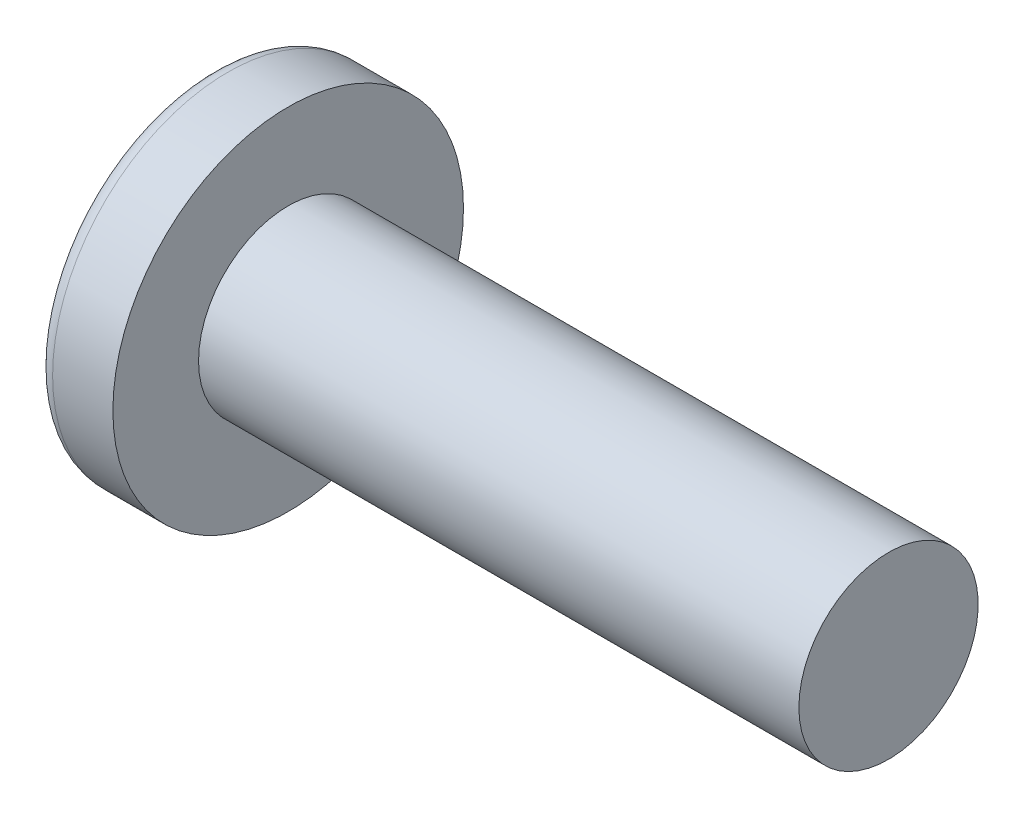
ISO-10303-21;
HEADER;
FILE_DESCRIPTION(('STEP AP214'),'2;1');
FILE_NAME('part.step','',(''),(''),'','','');
FILE_SCHEMA(('AUTOMOTIVE_DESIGN { 1 0 10303 214 1 1 1 1 }'));
ENDSEC;
DATA;
#1=APPLICATION_CONTEXT('core data for automotive mechanical design processes');
#2=APPLICATION_PROTOCOL_DEFINITION('international standard','automotive_design',2000,#1);
#3=PRODUCT_CONTEXT('',#1,'mechanical');
#4=PRODUCT('Part','Part','',(#3));
#5=PRODUCT_RELATED_PRODUCT_CATEGORY('part','',(#4));
#6=PRODUCT_DEFINITION_FORMATION('','',#4);
#7=PRODUCT_DEFINITION_CONTEXT('part definition',#1,'design');
#8=PRODUCT_DEFINITION('design','',#6,#7);
#9=PRODUCT_DEFINITION_SHAPE('','',#8);
#10=(LENGTH_UNIT() NAMED_UNIT(*) SI_UNIT(.MILLI.,.METRE.));
#11=(NAMED_UNIT(*) PLANE_ANGLE_UNIT() SI_UNIT($,.RADIAN.));
#12=(NAMED_UNIT(*) SI_UNIT($,.STERADIAN.) SOLID_ANGLE_UNIT());
#13=UNCERTAINTY_MEASURE_WITH_UNIT(LENGTH_MEASURE(1.E-05),#10,'distance_accuracy_value','');
#14=(GEOMETRIC_REPRESENTATION_CONTEXT(3) GLOBAL_UNCERTAINTY_ASSIGNED_CONTEXT((#13)) GLOBAL_UNIT_ASSIGNED_CONTEXT((#10,
#11,#12)) REPRESENTATION_CONTEXT('',''));
#15=CARTESIAN_POINT('',(0.,0.,0.));
#16=DIRECTION('',(0.,0.,1.));
#17=DIRECTION('',(1.,0.,0.));
#18=AXIS2_PLACEMENT_3D('',#15,#16,#17);
#19=CARTESIAN_POINT('',(4.55168,0.,0.));
#20=DIRECTION('',(-1.,0.,0.));
#21=DIRECTION('',(0.,1.,0.));
#22=AXIS2_PLACEMENT_3D('',#19,#20,#21);
#23=SPHERICAL_SURFACE('',#22,4.55168);
#24=CARTESIAN_POINT('',(0.870207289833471,0.,0.));
#25=DIRECTION('',(-1.,0.,0.));
#26=DIRECTION('',(0.,0.,1.));
#27=AXIS2_PLACEMENT_3D('',#24,#25,#26);
#28=CIRCLE('',#27,2.67666761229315);
#29=CARTESIAN_POINT('',(0.870207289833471,0.,2.67666761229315));
#30=VERTEX_POINT('',#29);
#31=EDGE_CURVE('E155',#30,#30,#28,.T.);
#32=ORIENTED_EDGE('',*,*,#31,.T.);
#33=EDGE_LOOP('',(#32));
#34=FACE_BOUND('',#33,.T.);
#35=CARTESIAN_POINT('',(4.54621406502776,-0.053976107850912,0.));
#36=DIRECTION('',(-0.100750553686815,-0.9949117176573,0.));
#37=DIRECTION('',(0.994911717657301,-0.100750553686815,0.));
#38=AXIS2_PLACEMENT_3D('',#35,#36,#37);
#39=CIRCLE('',#38,4.55135666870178);
#40=CARTESIAN_POINT('',(0.29828010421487,0.376194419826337,1.57634320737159));
#41=VERTEX_POINT('',#40);
#42=CARTESIAN_POINT('',(0.0357821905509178,0.402776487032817,0.402776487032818));
#43=VERTEX_POINT('',#42);
#44=EDGE_CURVE('E186',#41,#43,#39,.T.);
#45=ORIENTED_EDGE('',*,*,#44,.F.);
#46=CARTESIAN_POINT('',(3.65196023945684,0.,-1.11933639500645));
#47=DIRECTION('',(0.626498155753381,0.,0.77942290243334));
#48=DIRECTION('',(0.77942290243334,0.,-0.626498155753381));
#49=AXIS2_PLACEMENT_3D('',#46,#47,#48);
#50=CIRCLE('',#49,4.31918756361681);
#51=CARTESIAN_POINT('',(0.298280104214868,-0.376194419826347,1.57634320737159));
#52=VERTEX_POINT('',#51);
#53=EDGE_CURVE('E151',#41,#52,#50,.T.);
#54=ORIENTED_EDGE('',*,*,#53,.T.);
#55=CARTESIAN_POINT('',(4.54621406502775,0.053976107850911,0.));
#56=DIRECTION('',(-0.100750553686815,0.994911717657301,0.));
#57=DIRECTION('',(-0.994911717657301,-0.100750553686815,0.));
#58=AXIS2_PLACEMENT_3D('',#55,#56,#57);
#59=CIRCLE('',#58,4.55135666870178);
#60=CARTESIAN_POINT('',(0.0357821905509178,-0.402776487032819,0.402776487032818));
#61=VERTEX_POINT('',#60);
#62=EDGE_CURVE('E107',#61,#52,#59,.T.);
#63=ORIENTED_EDGE('',*,*,#62,.F.);
#64=CARTESIAN_POINT('',(4.54621406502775,0.,-0.0539761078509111));
#65=DIRECTION('',(-0.100750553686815,0.,-0.994911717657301));
#66=DIRECTION('',(-0.994911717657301,0.,0.100750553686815));
#67=AXIS2_PLACEMENT_3D('',#64,#65,#66);
#68=CIRCLE('',#67,4.55135666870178);
#69=CARTESIAN_POINT('',(0.298280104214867,-1.57634320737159,0.376194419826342));
#70=VERTEX_POINT('',#69);
#71=EDGE_CURVE('E132',#70,#61,#68,.T.);
#72=ORIENTED_EDGE('',*,*,#71,.F.);
#73=CARTESIAN_POINT('',(3.65196023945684,1.11933639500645,0.));
#74=DIRECTION('',(0.626498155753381,-0.77942290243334,0.));
#75=DIRECTION('',(0.77942290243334,0.626498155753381,0.));
#76=AXIS2_PLACEMENT_3D('',#73,#74,#75);
#77=CIRCLE('',#76,4.31918756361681);
#78=CARTESIAN_POINT('',(0.298280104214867,-1.57634320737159,-0.376194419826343));
#79=VERTEX_POINT('',#78);
#80=EDGE_CURVE('E140',#70,#79,#77,.T.);
#81=ORIENTED_EDGE('',*,*,#80,.T.);
#82=CARTESIAN_POINT('',(4.54621406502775,0.,0.053976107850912));
#83=DIRECTION('',(-0.100750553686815,0.,0.9949117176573));
#84=DIRECTION('',(0.994911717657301,0.,0.100750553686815));
#85=AXIS2_PLACEMENT_3D('',#82,#83,#84);
#86=CIRCLE('',#85,4.55135666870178);
#87=CARTESIAN_POINT('',(0.0357821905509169,-0.402776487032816,-0.402776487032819));
#88=VERTEX_POINT('',#87);
#89=EDGE_CURVE('E50',#88,#79,#86,.T.);
#90=ORIENTED_EDGE('',*,*,#89,.F.);
#91=CARTESIAN_POINT('',(0.298280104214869,-0.376194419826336,-1.57634320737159));
#92=VERTEX_POINT('',#91);
#93=EDGE_CURVE('E193',#92,#88,#59,.T.);
#94=ORIENTED_EDGE('',*,*,#93,.F.);
#95=CARTESIAN_POINT('',(3.65196023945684,0.,1.11933639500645));
#96=DIRECTION('',(0.626498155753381,0.,-0.77942290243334));
#97=DIRECTION('',(-0.77942290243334,0.,-0.626498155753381));
#98=AXIS2_PLACEMENT_3D('',#95,#96,#97);
#99=CIRCLE('',#98,4.31918756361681);
#100=CARTESIAN_POINT('',(0.29828010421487,0.376194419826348,-1.57634320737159));
#101=VERTEX_POINT('',#100);
#102=EDGE_CURVE('E133',#92,#101,#99,.T.);
#103=ORIENTED_EDGE('',*,*,#102,.T.);
#104=CARTESIAN_POINT('',(0.0357821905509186,0.40277648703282,-0.402776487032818));
#105=VERTEX_POINT('',#104);
#106=EDGE_CURVE('E181',#105,#101,#39,.T.);
#107=ORIENTED_EDGE('',*,*,#106,.F.);
#108=CARTESIAN_POINT('',(0.29828010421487,1.57634320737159,-0.376194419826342));
#109=VERTEX_POINT('',#108);
#110=EDGE_CURVE('E43',#109,#105,#86,.T.);
#111=ORIENTED_EDGE('',*,*,#110,.F.);
#112=CARTESIAN_POINT('',(3.65196023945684,-1.11933639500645,0.));
#113=DIRECTION('',(0.626498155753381,0.77942290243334,0.));
#114=DIRECTION('',(-0.77942290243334,0.626498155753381,0.));
#115=AXIS2_PLACEMENT_3D('',#112,#113,#114);
#116=CIRCLE('',#115,4.31918756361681);
#117=CARTESIAN_POINT('',(0.29828010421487,1.57634320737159,0.376194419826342));
#118=VERTEX_POINT('',#117);
#119=EDGE_CURVE('E11',#109,#118,#116,.T.);
#120=ORIENTED_EDGE('',*,*,#119,.T.);
#121=EDGE_CURVE('E169',#43,#118,#68,.T.);
#122=ORIENTED_EDGE('',*,*,#121,.F.);
#123=EDGE_LOOP('',(#45,#54,#63,#72,#81,#90,#94,#103,#107,#111,#120,#122));
#124=FACE_BOUND('',#123,.T.);
#125=ADVANCED_FACE('F35',(#34,#124),#23,.T.);
#126=CARTESIAN_POINT('',(2.2594,0.,-0.1776));
#127=DIRECTION('',(-0.100750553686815,0.,0.9949117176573));
#128=DIRECTION('',(0.994911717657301,0.,0.100750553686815));
#129=AXIS2_PLACEMENT_3D('',#126,#127,#128);
#130=PLANE('',#129);
#131=ORIENTED_EDGE('',*,*,#110,.T.);
#132=DIRECTION('',(0.989900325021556,-0.100243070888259,0.100243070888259));
#133=VECTOR('',#132,1.);
#134=CARTESIAN_POINT('',(2.27702336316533,0.175815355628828,-0.175815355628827));
#135=LINE('',#134,#133);
#136=CARTESIAN_POINT('',(2.0066,0.203200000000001,-0.203199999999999));
#137=VERTEX_POINT('',#136);
#138=EDGE_CURVE('E175',#105,#137,#135,.T.);
#139=ORIENTED_EDGE('',*,*,#138,.T.);
#140=DIRECTION('',(0.777006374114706,-0.624555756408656,0.0786841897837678));
#141=VECTOR('',#140,1.);
#142=CARTESIAN_POINT('',(0.,1.8161,-0.4064));
#143=LINE('',#142,#141);
#144=EDGE_CURVE('E156',#109,#137,#143,.T.);
#145=ORIENTED_EDGE('',*,*,#144,.F.);
#146=EDGE_LOOP('',(#131,#139,#145));
#147=FACE_BOUND('',#146,.T.);
#148=ADVANCED_FACE('F174',(#147),#130,.T.);
#149=DIRECTION('',(0.777006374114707,0.624555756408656,0.0786841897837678));
#150=VECTOR('',#149,1.);
#151=CARTESIAN_POINT('',(0.,-1.8161,-0.4064));
#152=LINE('',#151,#150);
#153=CARTESIAN_POINT('',(2.0066,-0.2032,-0.2032));
#154=VERTEX_POINT('',#153);
#155=EDGE_CURVE('E141',#79,#154,#152,.T.);
#156=ORIENTED_EDGE('',*,*,#155,.T.);
#157=DIRECTION('',(-0.989900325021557,-0.100243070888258,-0.100243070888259));
#158=VECTOR('',#157,1.);
#159=CARTESIAN_POINT('',(2.27702336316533,-0.175815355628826,-0.175815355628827));
#160=LINE('',#159,#158);
#161=EDGE_CURVE('E196',#154,#88,#160,.T.);
#162=ORIENTED_EDGE('',*,*,#161,.T.);
#163=ORIENTED_EDGE('',*,*,#89,.T.);
#164=EDGE_LOOP('',(#156,#162,#163));
#165=FACE_BOUND('',#164,.T.);
#166=ADVANCED_FACE('F211',(#165),#130,.T.);
#167=CARTESIAN_POINT('',(2.2594,0.,0.1776));
#168=DIRECTION('',(-0.100750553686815,0.,-0.994911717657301));
#169=DIRECTION('',(-0.994911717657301,0.,0.100750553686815));
#170=AXIS2_PLACEMENT_3D('',#167,#168,#169);
#171=PLANE('',#170);
#172=DIRECTION('',(0.777006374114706,-0.624555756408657,-0.0786841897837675));
#173=VECTOR('',#172,1.);
#174=CARTESIAN_POINT('',(0.,1.8161,0.406399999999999));
#175=LINE('',#174,#173);
#176=CARTESIAN_POINT('',(2.0066,0.2032,0.2032));
#177=VERTEX_POINT('',#176);
#178=EDGE_CURVE('E212',#118,#177,#175,.T.);
#179=ORIENTED_EDGE('',*,*,#178,.T.);
#180=DIRECTION('',(-0.989900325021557,0.100243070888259,0.100243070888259));
#181=VECTOR('',#180,1.);
#182=CARTESIAN_POINT('',(2.27702336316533,0.175815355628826,0.175815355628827));
#183=LINE('',#182,#181);
#184=EDGE_CURVE('E190',#177,#43,#183,.T.);
#185=ORIENTED_EDGE('',*,*,#184,.T.);
#186=ORIENTED_EDGE('',*,*,#121,.T.);
#187=EDGE_LOOP('',(#179,#185,#186));
#188=FACE_BOUND('',#187,.T.);
#189=ADVANCED_FACE('F216',(#188),#171,.T.);
#190=ORIENTED_EDGE('',*,*,#71,.T.);
#191=DIRECTION('',(0.989900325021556,0.100243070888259,-0.100243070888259));
#192=VECTOR('',#191,1.);
#193=CARTESIAN_POINT('',(2.27702336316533,-0.175815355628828,0.175815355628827));
#194=LINE('',#193,#192);
#195=CARTESIAN_POINT('',(2.0066,-0.203200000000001,0.203199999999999));
#196=VERTEX_POINT('',#195);
#197=EDGE_CURVE('E105',#61,#196,#194,.T.);
#198=ORIENTED_EDGE('',*,*,#197,.T.);
#199=DIRECTION('',(0.777006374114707,0.624555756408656,-0.0786841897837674));
#200=VECTOR('',#199,1.);
#201=CARTESIAN_POINT('',(0.,-1.8161,0.406399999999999));
#202=LINE('',#201,#200);
#203=EDGE_CURVE('E130',#70,#196,#202,.T.);
#204=ORIENTED_EDGE('',*,*,#203,.F.);
#205=EDGE_LOOP('',(#190,#198,#204));
#206=FACE_BOUND('',#205,.T.);
#207=ADVANCED_FACE('F129',(#206),#171,.T.);
#208=CARTESIAN_POINT('',(-25.4,0.,0.));
#209=DIRECTION('',(-1.,0.,0.));
#210=DIRECTION('',(0.,0.,1.));
#211=AXIS2_PLACEMENT_3D('',#208,#209,#210);
#212=CYLINDRICAL_SURFACE('',#211,1.4224);
#213=CARTESIAN_POINT('',(11.557,0.,0.));
#214=DIRECTION('',(-1.,0.,0.));
#215=DIRECTION('',(0.,0.,1.));
#216=AXIS2_PLACEMENT_3D('',#213,#214,#215);
#217=CIRCLE('',#216,1.4224);
#218=CARTESIAN_POINT('',(11.557,0.,1.4224));
#219=VERTEX_POINT('',#218);
#220=EDGE_CURVE('E152',#219,#219,#217,.T.);
#221=ORIENTED_EDGE('',*,*,#220,.T.);
#222=EDGE_LOOP('',(#221));
#223=FACE_BOUND('',#222,.T.);
#224=CARTESIAN_POINT('',(2.032,0.,0.));
#225=DIRECTION('',(-1.,0.,0.));
#226=DIRECTION('',(0.,0.,1.));
#227=AXIS2_PLACEMENT_3D('',#224,#225,#226);
#228=CIRCLE('',#227,1.4224);
#229=CARTESIAN_POINT('',(2.032,0.,1.4224));
#230=VERTEX_POINT('',#229);
#231=EDGE_CURVE('E165',#230,#230,#228,.T.);
#232=ORIENTED_EDGE('',*,*,#231,.F.);
#233=EDGE_LOOP('',(#232));
#234=FACE_BOUND('',#233,.T.);
#235=ADVANCED_FACE('F37',(#223,#234),#212,.T.);
#236=CARTESIAN_POINT('',(2.032,1.4224,0.));
#237=DIRECTION('',(-1.,0.,0.));
#238=DIRECTION('',(0.,0.,1.));
#239=AXIS2_PLACEMENT_3D('',#236,#237,#238);
#240=PLANE('',#239);
#241=CARTESIAN_POINT('',(2.032,0.,0.));
#242=DIRECTION('',(-1.,0.,0.));
#243=DIRECTION('',(0.,0.,1.));
#244=AXIS2_PLACEMENT_3D('',#241,#242,#243);
#245=CIRCLE('',#244,2.7813);
#246=CARTESIAN_POINT('',(2.032,0.,2.7813));
#247=VERTEX_POINT('',#246);
#248=EDGE_CURVE('E162',#247,#247,#245,.T.);
#249=ORIENTED_EDGE('',*,*,#248,.F.);
#250=EDGE_LOOP('',(#249));
#251=FACE_BOUND('',#250,.T.);
#252=ORIENTED_EDGE('',*,*,#231,.T.);
#253=EDGE_LOOP('',(#252));
#254=FACE_BOUND('',#253,.T.);
#255=ADVANCED_FACE('F244',(#251,#254),#240,.F.);
#256=CARTESIAN_POINT('',(-25.4,0.,0.));
#257=DIRECTION('',(-1.,0.,0.));
#258=DIRECTION('',(0.,0.,1.));
#259=AXIS2_PLACEMENT_3D('',#256,#257,#258);
#260=CYLINDRICAL_SURFACE('',#259,2.7813);
#261=ORIENTED_EDGE('',*,*,#248,.T.);
#262=EDGE_LOOP('',(#261));
#263=FACE_BOUND('',#262,.T.);
#264=CARTESIAN_POINT('',(1.07564661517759,0.,0.));
#265=DIRECTION('',(-1.,0.,0.));
#266=DIRECTION('',(0.,0.,1.));
#267=AXIS2_PLACEMENT_3D('',#264,#265,#266);
#268=CIRCLE('',#267,2.7813);
#269=CARTESIAN_POINT('',(1.07564661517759,0.,2.7813));
#270=VERTEX_POINT('',#269);
#271=EDGE_CURVE('E159',#270,#270,#268,.T.);
#272=ORIENTED_EDGE('',*,*,#271,.F.);
#273=EDGE_LOOP('',(#272));
#274=FACE_BOUND('',#273,.T.);
#275=ADVANCED_FACE('F241',(#263,#274),#260,.T.);
#276=CARTESIAN_POINT('',(1.07564661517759,0.,0.));
#277=DIRECTION('',(-1.,0.,0.));
#278=DIRECTION('',(0.,0.,1.));
#279=AXIS2_PLACEMENT_3D('',#276,#277,#278);
#280=TOROIDAL_SURFACE('',#279,2.5273,0.254);
#281=ORIENTED_EDGE('',*,*,#271,.T.);
#282=EDGE_LOOP('',(#281));
#283=FACE_BOUND('',#282,.T.);
#284=ORIENTED_EDGE('',*,*,#31,.F.);
#285=EDGE_LOOP('',(#284));
#286=FACE_BOUND('',#285,.T.);
#287=ADVANCED_FACE('F238',(#283,#286),#280,.T.);
#288=CARTESIAN_POINT('',(11.557,1.4224,0.));
#289=DIRECTION('',(1.,0.,0.));
#290=DIRECTION('',(0.,0.,-1.));
#291=AXIS2_PLACEMENT_3D('',#288,#289,#290);
#292=PLANE('',#291);
#293=ORIENTED_EDGE('',*,*,#220,.F.);
#294=EDGE_LOOP('',(#293));
#295=FACE_BOUND('',#294,.T.);
#296=ADVANCED_FACE('F236',(#295),#292,.T.);
#297=CARTESIAN_POINT('',(2.0066,0.2032,0.2032));
#298=DIRECTION('',(0.626498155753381,0.77942290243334,0.));
#299=DIRECTION('',(-0.77942290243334,0.626498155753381,0.));
#300=AXIS2_PLACEMENT_3D('',#297,#298,#299);
#301=PLANE('',#300);
#302=ORIENTED_EDGE('',*,*,#144,.T.);
#303=DIRECTION('',(0.,0.,-1.));
#304=VECTOR('',#303,1.);
#305=CARTESIAN_POINT('',(2.0066,0.2032,0.2032));
#306=LINE('',#305,#304);
#307=EDGE_CURVE('E123',#177,#137,#306,.T.);
#308=ORIENTED_EDGE('',*,*,#307,.F.);
#309=ORIENTED_EDGE('',*,*,#178,.F.);
#310=ORIENTED_EDGE('',*,*,#119,.F.);
#311=EDGE_LOOP('',(#302,#308,#309,#310));
#312=FACE_BOUND('',#311,.T.);
#313=ADVANCED_FACE('F215',(#312),#301,.F.);
#314=CARTESIAN_POINT('',(2.0066,-0.2032,-0.2032));
#315=DIRECTION('',(0.626498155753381,-0.77942290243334,0.));
#316=DIRECTION('',(0.77942290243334,0.626498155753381,0.));
#317=AXIS2_PLACEMENT_3D('',#314,#315,#316);
#318=PLANE('',#317);
#319=ORIENTED_EDGE('',*,*,#203,.T.);
#320=DIRECTION('',(0.,0.,1.));
#321=VECTOR('',#320,1.);
#322=CARTESIAN_POINT('',(2.0066,-0.2032,-0.2032));
#323=LINE('',#322,#321);
#324=EDGE_CURVE('E122',#154,#196,#323,.T.);
#325=ORIENTED_EDGE('',*,*,#324,.F.);
#326=ORIENTED_EDGE('',*,*,#155,.F.);
#327=ORIENTED_EDGE('',*,*,#80,.F.);
#328=EDGE_LOOP('',(#319,#325,#326,#327));
#329=FACE_BOUND('',#328,.T.);
#330=ADVANCED_FACE('F137',(#329),#318,.F.);
#331=CARTESIAN_POINT('',(2.0066,0.2032,-0.2032));
#332=DIRECTION('',(-1.,0.,0.));
#333=DIRECTION('',(0.,0.,1.));
#334=AXIS2_PLACEMENT_3D('',#331,#332,#333);
#335=PLANE('',#334);
#336=DIRECTION('',(0.,1.,0.));
#337=VECTOR('',#336,1.);
#338=CARTESIAN_POINT('',(2.0066,-0.2032,-0.2032));
#339=LINE('',#338,#337);
#340=EDGE_CURVE('E145',#154,#137,#339,.T.);
#341=ORIENTED_EDGE('',*,*,#340,.F.);
#342=ORIENTED_EDGE('',*,*,#324,.T.);
#343=DIRECTION('',(0.,-1.,0.));
#344=VECTOR('',#343,1.);
#345=CARTESIAN_POINT('',(2.0066,0.2032,0.2032));
#346=LINE('',#345,#344);
#347=EDGE_CURVE('E114',#177,#196,#346,.T.);
#348=ORIENTED_EDGE('',*,*,#347,.F.);
#349=ORIENTED_EDGE('',*,*,#307,.T.);
#350=EDGE_LOOP('',(#341,#342,#348,#349));
#351=FACE_BOUND('',#350,.T.);
#352=ADVANCED_FACE('F143',(#351),#335,.T.);
#353=CARTESIAN_POINT('',(2.0066,0.203200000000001,-0.203199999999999));
#354=DIRECTION('',(0.626498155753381,0.,-0.77942290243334));
#355=DIRECTION('',(0.77942290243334,0.,0.626498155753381));
#356=AXIS2_PLACEMENT_3D('',#353,#354,#355);
#357=PLANE('',#356);
#358=DIRECTION('',(0.777006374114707,0.0786841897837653,0.624555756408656));
#359=VECTOR('',#358,1.);
#360=CARTESIAN_POINT('',(0.,-0.406399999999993,-1.8161));
#361=LINE('',#360,#359);
#362=EDGE_CURVE('E201',#92,#154,#361,.T.);
#363=ORIENTED_EDGE('',*,*,#362,.T.);
#364=ORIENTED_EDGE('',*,*,#340,.T.);
#365=DIRECTION('',(0.777006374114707,-0.0786841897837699,0.624555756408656));
#366=VECTOR('',#365,1.);
#367=CARTESIAN_POINT('',(0.,0.406400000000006,-1.8161));
#368=LINE('',#367,#366);
#369=EDGE_CURVE('E111',#101,#137,#368,.T.);
#370=ORIENTED_EDGE('',*,*,#369,.F.);
#371=ORIENTED_EDGE('',*,*,#102,.F.);
#372=EDGE_LOOP('',(#363,#364,#370,#371));
#373=FACE_BOUND('',#372,.T.);
#374=ADVANCED_FACE('F206',(#373),#357,.F.);
#375=CARTESIAN_POINT('',(2.2594,-0.1776,0.));
#376=DIRECTION('',(-0.100750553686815,0.994911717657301,0.));
#377=DIRECTION('',(-0.994911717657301,-0.100750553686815,0.));
#378=AXIS2_PLACEMENT_3D('',#375,#376,#377);
#379=PLANE('',#378);
#380=ORIENTED_EDGE('',*,*,#93,.T.);
#381=ORIENTED_EDGE('',*,*,#161,.F.);
#382=ORIENTED_EDGE('',*,*,#362,.F.);
#383=EDGE_LOOP('',(#380,#381,#382));
#384=FACE_BOUND('',#383,.T.);
#385=ADVANCED_FACE('F210',(#384),#379,.T.);
#386=CARTESIAN_POINT('',(2.2594,0.1776,0.));
#387=DIRECTION('',(-0.100750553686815,-0.9949117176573,0.));
#388=DIRECTION('',(0.994911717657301,-0.100750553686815,0.));
#389=AXIS2_PLACEMENT_3D('',#386,#387,#388);
#390=PLANE('',#389);
#391=ORIENTED_EDGE('',*,*,#106,.T.);
#392=ORIENTED_EDGE('',*,*,#369,.T.);
#393=ORIENTED_EDGE('',*,*,#138,.F.);
#394=EDGE_LOOP('',(#391,#392,#393));
#395=FACE_BOUND('',#394,.T.);
#396=ADVANCED_FACE('F204',(#395),#390,.T.);
#397=CARTESIAN_POINT('',(2.0066,-0.203200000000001,0.203199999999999));
#398=DIRECTION('',(0.626498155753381,0.,0.77942290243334));
#399=DIRECTION('',(-0.77942290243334,0.,0.626498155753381));
#400=AXIS2_PLACEMENT_3D('',#397,#398,#399);
#401=PLANE('',#400);
#402=DIRECTION('',(0.777006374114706,-0.0786841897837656,-0.624555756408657));
#403=VECTOR('',#402,1.);
#404=CARTESIAN_POINT('',(0.,0.406399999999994,1.8161));
#405=LINE('',#404,#403);
#406=EDGE_CURVE('E110',#41,#177,#405,.T.);
#407=ORIENTED_EDGE('',*,*,#406,.T.);
#408=ORIENTED_EDGE('',*,*,#347,.T.);
#409=DIRECTION('',(0.777006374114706,0.0786841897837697,-0.624555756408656));
#410=VECTOR('',#409,1.);
#411=CARTESIAN_POINT('',(0.,-0.406400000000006,1.8161));
#412=LINE('',#411,#410);
#413=EDGE_CURVE('E101',#52,#196,#412,.T.);
#414=ORIENTED_EDGE('',*,*,#413,.F.);
#415=ORIENTED_EDGE('',*,*,#53,.F.);
#416=EDGE_LOOP('',(#407,#408,#414,#415));
#417=FACE_BOUND('',#416,.T.);
#418=ADVANCED_FACE('F115',(#417),#401,.F.);
#419=ORIENTED_EDGE('',*,*,#44,.T.);
#420=ORIENTED_EDGE('',*,*,#184,.F.);
#421=ORIENTED_EDGE('',*,*,#406,.F.);
#422=EDGE_LOOP('',(#419,#420,#421));
#423=FACE_BOUND('',#422,.T.);
#424=ADVANCED_FACE('F217',(#423),#390,.T.);
#425=ORIENTED_EDGE('',*,*,#62,.T.);
#426=ORIENTED_EDGE('',*,*,#413,.T.);
#427=ORIENTED_EDGE('',*,*,#197,.F.);
#428=EDGE_LOOP('',(#425,#426,#427));
#429=FACE_BOUND('',#428,.T.);
#430=ADVANCED_FACE('F103',(#429),#379,.T.);
#431=CLOSED_SHELL('',(#125,#148,#166,#189,#207,#235,#255,#275,#287,#296,#313,#330,#352,#374,
#385,#396,#418,#424,#430));
#432=MANIFOLD_SOLID_BREP('B2',#431);
#433=ADVANCED_BREP_SHAPE_REPRESENTATION('',(#18,#432),#14);
#434=SHAPE_DEFINITION_REPRESENTATION(#9,#433);
ENDSEC;
END-ISO-10303-21;
